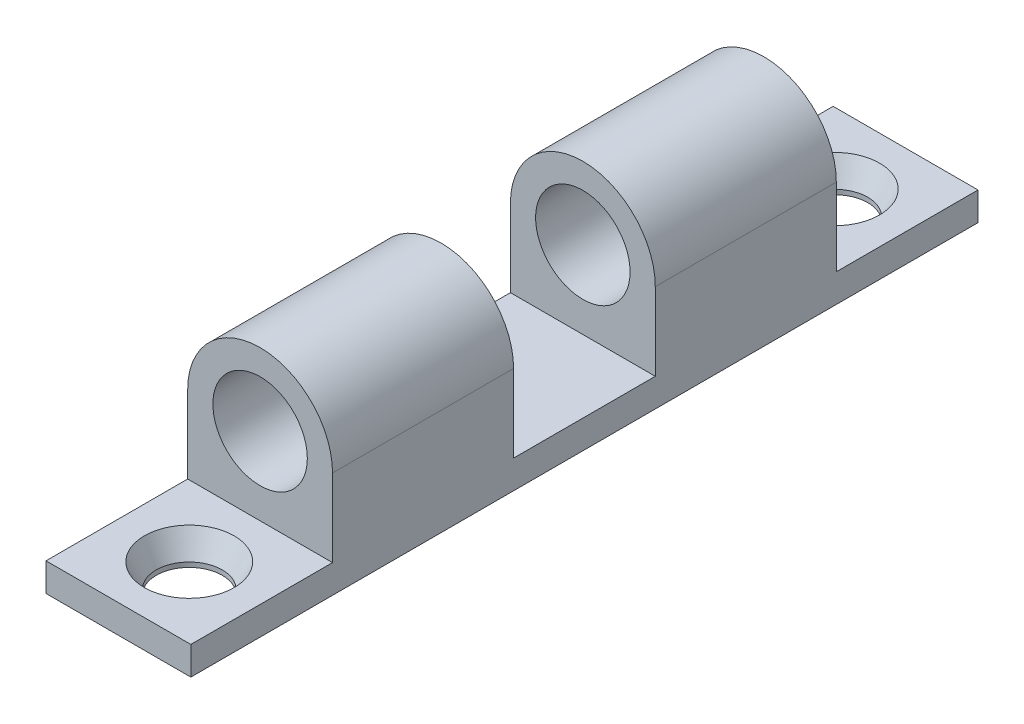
ISO-10303-21;
HEADER;
FILE_DESCRIPTION(('STEP AP214'),'2;1');
FILE_NAME('part.step','',(''),(''),'','','');
FILE_SCHEMA(('AUTOMOTIVE_DESIGN { 1 0 10303 214 1 1 1 1 }'));
ENDSEC;
DATA;
#1=APPLICATION_CONTEXT('core data for automotive mechanical design processes');
#2=APPLICATION_PROTOCOL_DEFINITION('international standard','automotive_design',2000,#1);
#3=PRODUCT_CONTEXT('',#1,'mechanical');
#4=PRODUCT('Part','Part','',(#3));
#5=PRODUCT_RELATED_PRODUCT_CATEGORY('part','',(#4));
#6=PRODUCT_DEFINITION_FORMATION('','',#4);
#7=PRODUCT_DEFINITION_CONTEXT('part definition',#1,'design');
#8=PRODUCT_DEFINITION('design','',#6,#7);
#9=PRODUCT_DEFINITION_SHAPE('','',#8);
#10=(LENGTH_UNIT() NAMED_UNIT(*) SI_UNIT(.MILLI.,.METRE.));
#11=(NAMED_UNIT(*) PLANE_ANGLE_UNIT() SI_UNIT($,.RADIAN.));
#12=(NAMED_UNIT(*) SI_UNIT($,.STERADIAN.) SOLID_ANGLE_UNIT());
#13=UNCERTAINTY_MEASURE_WITH_UNIT(LENGTH_MEASURE(1.E-05),#10,'distance_accuracy_value','');
#14=(GEOMETRIC_REPRESENTATION_CONTEXT(3) GLOBAL_UNCERTAINTY_ASSIGNED_CONTEXT((#13)) GLOBAL_UNIT_ASSIGNED_CONTEXT((#10,
#11,#12)) REPRESENTATION_CONTEXT('',''));
#15=CARTESIAN_POINT('',(0.,0.,0.));
#16=DIRECTION('',(0.,0.,1.));
#17=DIRECTION('',(1.,0.,0.));
#18=AXIS2_PLACEMENT_3D('',#15,#16,#17);
#19=CARTESIAN_POINT('',(0.,6.73,0.));
#20=DIRECTION('',(0.,0.,1.));
#21=DIRECTION('',(1.,0.,0.));
#22=AXIS2_PLACEMENT_3D('',#19,#20,#21);
#23=CYLINDRICAL_SURFACE('',#22,3.);
#24=CARTESIAN_POINT('',(0.,6.73,-4.5));
#25=DIRECTION('',(0.,0.,1.));
#26=DIRECTION('',(1.,0.,0.));
#27=AXIS2_PLACEMENT_3D('',#24,#25,#26);
#28=CIRCLE('',#27,3.);
#29=CARTESIAN_POINT('',(3.,6.73,-4.5));
#30=VERTEX_POINT('',#29);
#31=EDGE_CURVE('E198',#30,#30,#28,.T.);
#32=ORIENTED_EDGE('',*,*,#31,.T.);
#33=EDGE_LOOP('',(#32));
#34=FACE_BOUND('',#33,.T.);
#35=CARTESIAN_POINT('',(0.,6.73,-16.));
#36=DIRECTION('',(0.,0.,1.));
#37=DIRECTION('',(1.,0.,0.));
#38=AXIS2_PLACEMENT_3D('',#35,#36,#37);
#39=CIRCLE('',#38,3.);
#40=CARTESIAN_POINT('',(3.,6.73,-16.));
#41=VERTEX_POINT('',#40);
#42=EDGE_CURVE('E19',#41,#41,#39,.F.);
#43=ORIENTED_EDGE('',*,*,#42,.T.);
#44=EDGE_LOOP('',(#43));
#45=FACE_BOUND('',#44,.T.);
#46=ADVANCED_FACE('F16',(#34,#45),#23,.F.);
#47=CARTESIAN_POINT('',(0.,6.73,0.));
#48=DIRECTION('',(0.,0.,1.));
#49=DIRECTION('',(1.,0.,0.));
#50=AXIS2_PLACEMENT_3D('',#47,#48,#49);
#51=CYLINDRICAL_SURFACE('',#50,3.);
#52=CARTESIAN_POINT('',(0.,6.73,16.));
#53=DIRECTION('',(0.,0.,1.));
#54=DIRECTION('',(1.,0.,0.));
#55=AXIS2_PLACEMENT_3D('',#52,#53,#54);
#56=CIRCLE('',#55,3.);
#57=CARTESIAN_POINT('',(3.,6.73,16.));
#58=VERTEX_POINT('',#57);
#59=EDGE_CURVE('E187',#58,#58,#56,.T.);
#60=ORIENTED_EDGE('',*,*,#59,.T.);
#61=EDGE_LOOP('',(#60));
#62=FACE_BOUND('',#61,.T.);
#63=CARTESIAN_POINT('',(0.,6.73,4.5));
#64=DIRECTION('',(0.,0.,1.));
#65=DIRECTION('',(1.,0.,0.));
#66=AXIS2_PLACEMENT_3D('',#63,#64,#65);
#67=CIRCLE('',#66,3.);
#68=CARTESIAN_POINT('',(3.,6.73,4.5));
#69=VERTEX_POINT('',#68);
#70=EDGE_CURVE('E194',#69,#69,#67,.F.);
#71=ORIENTED_EDGE('',*,*,#70,.T.);
#72=EDGE_LOOP('',(#71));
#73=FACE_BOUND('',#72,.T.);
#74=ADVANCED_FACE('F329',(#62,#73),#51,.F.);
#75=CARTESIAN_POINT('',(4.6,1.8,-16.));
#76=DIRECTION('',(0.,0.,1.));
#77=DIRECTION('',(1.,0.,0.));
#78=AXIS2_PLACEMENT_3D('',#75,#76,#77);
#79=PLANE('',#78);
#80=ORIENTED_EDGE('',*,*,#42,.F.);
#81=EDGE_LOOP('',(#80));
#82=FACE_BOUND('',#81,.T.);
#83=DIRECTION('',(0.,1.,0.));
#84=VECTOR('',#83,1.);
#85=CARTESIAN_POINT('',(4.6,6.73,-16.));
#86=LINE('',#85,#84);
#87=CARTESIAN_POINT('',(4.6,1.8,-16.));
#88=VERTEX_POINT('',#87);
#89=CARTESIAN_POINT('',(4.6,6.73,-16.));
#90=VERTEX_POINT('',#89);
#91=EDGE_CURVE('E106',#88,#90,#86,.T.);
#92=ORIENTED_EDGE('',*,*,#91,.F.);
#93=DIRECTION('',(1.,0.,0.));
#94=VECTOR('',#93,1.);
#95=CARTESIAN_POINT('',(0.,1.8,-16.));
#96=LINE('',#95,#94);
#97=CARTESIAN_POINT('',(-4.6,1.8,-16.));
#98=VERTEX_POINT('',#97);
#99=EDGE_CURVE('E133',#98,#88,#96,.T.);
#100=ORIENTED_EDGE('',*,*,#99,.F.);
#101=DIRECTION('',(0.,1.,0.));
#102=VECTOR('',#101,1.);
#103=CARTESIAN_POINT('',(-4.6,0.,-16.));
#104=LINE('',#103,#102);
#105=CARTESIAN_POINT('',(-4.6,6.73,-16.));
#106=VERTEX_POINT('',#105);
#107=EDGE_CURVE('E109',#106,#98,#104,.F.);
#108=ORIENTED_EDGE('',*,*,#107,.F.);
#109=CARTESIAN_POINT('',(0.,6.73,-16.));
#110=DIRECTION('',(0.,0.,1.));
#111=DIRECTION('',(1.,0.,0.));
#112=AXIS2_PLACEMENT_3D('',#109,#110,#111);
#113=CIRCLE('',#112,4.6);
#114=EDGE_CURVE('E102',#90,#106,#113,.T.);
#115=ORIENTED_EDGE('',*,*,#114,.F.);
#116=EDGE_LOOP('',(#92,#100,#108,#115));
#117=FACE_BOUND('',#116,.T.);
#118=ADVANCED_FACE('F104',(#82,#117),#79,.F.);
#119=CARTESIAN_POINT('',(0.,6.73,0.));
#120=DIRECTION('',(0.,0.,1.));
#121=DIRECTION('',(1.,0.,0.));
#122=AXIS2_PLACEMENT_3D('',#119,#120,#121);
#123=CYLINDRICAL_SURFACE('',#122,4.6);
#124=CARTESIAN_POINT('',(0.,6.73,-4.5));
#125=DIRECTION('',(0.,0.,1.));
#126=DIRECTION('',(1.,0.,0.));
#127=AXIS2_PLACEMENT_3D('',#124,#125,#126);
#128=CIRCLE('',#127,4.6);
#129=CARTESIAN_POINT('',(-4.6,6.73,-4.5));
#130=VERTEX_POINT('',#129);
#131=CARTESIAN_POINT('',(4.6,6.73,-4.5));
#132=VERTEX_POINT('',#131);
#133=EDGE_CURVE('E113',#130,#132,#128,.F.);
#134=ORIENTED_EDGE('',*,*,#133,.T.);
#135=DIRECTION('',(0.,0.,-1.));
#136=VECTOR('',#135,1.);
#137=CARTESIAN_POINT('',(4.6,6.73,0.));
#138=LINE('',#137,#136);
#139=EDGE_CURVE('E115',#90,#132,#138,.F.);
#140=ORIENTED_EDGE('',*,*,#139,.F.);
#141=ORIENTED_EDGE('',*,*,#114,.T.);
#142=DIRECTION('',(0.,0.,1.));
#143=VECTOR('',#142,1.);
#144=CARTESIAN_POINT('',(-4.6,6.73,0.));
#145=LINE('',#144,#143);
#146=EDGE_CURVE('E139',#130,#106,#145,.F.);
#147=ORIENTED_EDGE('',*,*,#146,.F.);
#148=EDGE_LOOP('',(#134,#140,#141,#147));
#149=FACE_BOUND('',#148,.T.);
#150=ADVANCED_FACE('F116',(#149),#123,.T.);
#151=CARTESIAN_POINT('',(-4.6,1.8,-4.5));
#152=DIRECTION('',(0.,0.,-1.));
#153=DIRECTION('',(-1.,0.,0.));
#154=AXIS2_PLACEMENT_3D('',#151,#152,#153);
#155=PLANE('',#154);
#156=ORIENTED_EDGE('',*,*,#31,.F.);
#157=EDGE_LOOP('',(#156));
#158=FACE_BOUND('',#157,.T.);
#159=DIRECTION('',(0.,1.,0.));
#160=VECTOR('',#159,1.);
#161=CARTESIAN_POINT('',(-4.6,0.,-4.5));
#162=LINE('',#161,#160);
#163=CARTESIAN_POINT('',(-4.6,1.8,-4.5));
#164=VERTEX_POINT('',#163);
#165=EDGE_CURVE('E141',#164,#130,#162,.T.);
#166=ORIENTED_EDGE('',*,*,#165,.F.);
#167=DIRECTION('',(1.,0.,0.));
#168=VECTOR('',#167,1.);
#169=CARTESIAN_POINT('',(0.,1.8,-4.5));
#170=LINE('',#169,#168);
#171=CARTESIAN_POINT('',(4.6,1.8,-4.5));
#172=VERTEX_POINT('',#171);
#173=EDGE_CURVE('E201',#172,#164,#170,.F.);
#174=ORIENTED_EDGE('',*,*,#173,.F.);
#175=DIRECTION('',(0.,1.,0.));
#176=VECTOR('',#175,1.);
#177=CARTESIAN_POINT('',(4.6,6.73,-4.5));
#178=LINE('',#177,#176);
#179=EDGE_CURVE('E120',#132,#172,#178,.F.);
#180=ORIENTED_EDGE('',*,*,#179,.F.);
#181=ORIENTED_EDGE('',*,*,#133,.F.);
#182=EDGE_LOOP('',(#166,#174,#180,#181));
#183=FACE_BOUND('',#182,.T.);
#184=ADVANCED_FACE('F322',(#158,#183),#155,.F.);
#185=CARTESIAN_POINT('',(0.,1.8,0.));
#186=DIRECTION('',(0.,1.,0.));
#187=DIRECTION('',(0.,0.,1.));
#188=AXIS2_PLACEMENT_3D('',#185,#186,#187);
#189=PLANE('',#188);
#190=DIRECTION('',(0.,0.,-1.));
#191=VECTOR('',#190,1.);
#192=CARTESIAN_POINT('',(4.6,1.8,0.));
#193=LINE('',#192,#191);
#194=CARTESIAN_POINT('',(4.6,1.8,4.5));
#195=VERTEX_POINT('',#194);
#196=EDGE_CURVE('E211',#172,#195,#193,.F.);
#197=ORIENTED_EDGE('',*,*,#196,.F.);
#198=ORIENTED_EDGE('',*,*,#173,.T.);
#199=DIRECTION('',(0.,0.,1.));
#200=VECTOR('',#199,1.);
#201=CARTESIAN_POINT('',(-4.6,1.8,0.));
#202=LINE('',#201,#200);
#203=CARTESIAN_POINT('',(-4.6,1.8,4.5));
#204=VERTEX_POINT('',#203);
#205=EDGE_CURVE('E144',#204,#164,#202,.F.);
#206=ORIENTED_EDGE('',*,*,#205,.F.);
#207=DIRECTION('',(1.,0.,0.));
#208=VECTOR('',#207,1.);
#209=CARTESIAN_POINT('',(4.6,1.8,4.5));
#210=LINE('',#209,#208);
#211=EDGE_CURVE('E197',#204,#195,#210,.T.);
#212=ORIENTED_EDGE('',*,*,#211,.T.);
#213=EDGE_LOOP('',(#197,#198,#206,#212));
#214=FACE_BOUND('',#213,.T.);
#215=ADVANCED_FACE('F318',(#214),#189,.T.);
#216=CARTESIAN_POINT('',(4.6,1.8,4.5));
#217=DIRECTION('',(0.,0.,1.));
#218=DIRECTION('',(1.,0.,0.));
#219=AXIS2_PLACEMENT_3D('',#216,#217,#218);
#220=PLANE('',#219);
#221=ORIENTED_EDGE('',*,*,#70,.F.);
#222=EDGE_LOOP('',(#221));
#223=FACE_BOUND('',#222,.T.);
#224=DIRECTION('',(0.,1.,0.));
#225=VECTOR('',#224,1.);
#226=CARTESIAN_POINT('',(4.6,6.73,4.5));
#227=LINE('',#226,#225);
#228=CARTESIAN_POINT('',(4.6,6.73,4.5));
#229=VERTEX_POINT('',#228);
#230=EDGE_CURVE('E213',#195,#229,#227,.T.);
#231=ORIENTED_EDGE('',*,*,#230,.F.);
#232=ORIENTED_EDGE('',*,*,#211,.F.);
#233=DIRECTION('',(0.,1.,0.));
#234=VECTOR('',#233,1.);
#235=CARTESIAN_POINT('',(-4.6,0.,4.5));
#236=LINE('',#235,#234);
#237=CARTESIAN_POINT('',(-4.6,6.73,4.5));
#238=VERTEX_POINT('',#237);
#239=EDGE_CURVE('E147',#238,#204,#236,.F.);
#240=ORIENTED_EDGE('',*,*,#239,.F.);
#241=CARTESIAN_POINT('',(0.,6.73,4.5));
#242=DIRECTION('',(0.,0.,1.));
#243=DIRECTION('',(1.,0.,0.));
#244=AXIS2_PLACEMENT_3D('',#241,#242,#243);
#245=CIRCLE('',#244,4.6);
#246=EDGE_CURVE('E192',#229,#238,#245,.T.);
#247=ORIENTED_EDGE('',*,*,#246,.F.);
#248=EDGE_LOOP('',(#231,#232,#240,#247));
#249=FACE_BOUND('',#248,.T.);
#250=ADVANCED_FACE('F314',(#223,#249),#220,.F.);
#251=CARTESIAN_POINT('',(0.,6.73,0.));
#252=DIRECTION('',(0.,0.,1.));
#253=DIRECTION('',(1.,0.,0.));
#254=AXIS2_PLACEMENT_3D('',#251,#252,#253);
#255=CYLINDRICAL_SURFACE('',#254,4.6);
#256=ORIENTED_EDGE('',*,*,#246,.T.);
#257=DIRECTION('',(0.,0.,1.));
#258=VECTOR('',#257,1.);
#259=CARTESIAN_POINT('',(-4.6,6.73,0.));
#260=LINE('',#259,#258);
#261=CARTESIAN_POINT('',(-4.6,6.73,16.));
#262=VERTEX_POINT('',#261);
#263=EDGE_CURVE('E150',#262,#238,#260,.F.);
#264=ORIENTED_EDGE('',*,*,#263,.F.);
#265=CARTESIAN_POINT('',(0.,6.73,16.));
#266=DIRECTION('',(0.,0.,1.));
#267=DIRECTION('',(1.,0.,0.));
#268=AXIS2_PLACEMENT_3D('',#265,#266,#267);
#269=CIRCLE('',#268,4.6);
#270=CARTESIAN_POINT('',(4.6,6.73,16.));
#271=VERTEX_POINT('',#270);
#272=EDGE_CURVE('E190',#262,#271,#269,.F.);
#273=ORIENTED_EDGE('',*,*,#272,.T.);
#274=DIRECTION('',(0.,0.,-1.));
#275=VECTOR('',#274,1.);
#276=CARTESIAN_POINT('',(4.6,6.73,0.));
#277=LINE('',#276,#275);
#278=EDGE_CURVE('E215',#229,#271,#277,.F.);
#279=ORIENTED_EDGE('',*,*,#278,.F.);
#280=EDGE_LOOP('',(#256,#264,#273,#279));
#281=FACE_BOUND('',#280,.T.);
#282=ADVANCED_FACE('F310',(#281),#255,.T.);
#283=CARTESIAN_POINT('',(-4.6,1.8,16.));
#284=DIRECTION('',(0.,0.,-1.));
#285=DIRECTION('',(-1.,0.,0.));
#286=AXIS2_PLACEMENT_3D('',#283,#284,#285);
#287=PLANE('',#286);
#288=ORIENTED_EDGE('',*,*,#59,.F.);
#289=EDGE_LOOP('',(#288));
#290=FACE_BOUND('',#289,.T.);
#291=DIRECTION('',(0.,1.,0.));
#292=VECTOR('',#291,1.);
#293=CARTESIAN_POINT('',(-4.6,0.,16.));
#294=LINE('',#293,#292);
#295=CARTESIAN_POINT('',(-4.6,1.8,16.));
#296=VERTEX_POINT('',#295);
#297=EDGE_CURVE('E153',#296,#262,#294,.T.);
#298=ORIENTED_EDGE('',*,*,#297,.F.);
#299=DIRECTION('',(1.,0.,0.));
#300=VECTOR('',#299,1.);
#301=CARTESIAN_POINT('',(0.,1.8,16.));
#302=LINE('',#301,#300);
#303=CARTESIAN_POINT('',(4.6,1.8,16.));
#304=VERTEX_POINT('',#303);
#305=EDGE_CURVE('E136',#304,#296,#302,.F.);
#306=ORIENTED_EDGE('',*,*,#305,.F.);
#307=DIRECTION('',(0.,1.,0.));
#308=VECTOR('',#307,1.);
#309=CARTESIAN_POINT('',(4.6,6.73,16.));
#310=LINE('',#309,#308);
#311=EDGE_CURVE('E219',#271,#304,#310,.F.);
#312=ORIENTED_EDGE('',*,*,#311,.F.);
#313=ORIENTED_EDGE('',*,*,#272,.F.);
#314=EDGE_LOOP('',(#298,#306,#312,#313));
#315=FACE_BOUND('',#314,.T.);
#316=ADVANCED_FACE('F306',(#290,#315),#287,.F.);
#317=CARTESIAN_POINT('',(0.,1.8,20.5));
#318=DIRECTION('',(0.,1.,0.));
#319=DIRECTION('',(0.,0.,1.));
#320=AXIS2_PLACEMENT_3D('',#317,#318,#319);
#321=PLANE('',#320);
#322=CARTESIAN_POINT('',(0.,1.80000000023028,20.5));
#323=DIRECTION('',(0.,1.,0.));
#324=DIRECTION('',(-1.,0.,0.));
#325=AXIS2_PLACEMENT_3D('',#322,#323,#324);
#326=CIRCLE('',#325,2.84999999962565);
#327=CARTESIAN_POINT('',(-2.84999999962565,1.80000000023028,20.5));
#328=VERTEX_POINT('',#327);
#329=EDGE_CURVE('E165',#328,#328,#326,.F.);
#330=ORIENTED_EDGE('',*,*,#329,.T.);
#331=EDGE_LOOP('',(#330));
#332=FACE_BOUND('',#331,.T.);
#333=ORIENTED_EDGE('',*,*,#305,.T.);
#334=DIRECTION('',(0.,0.,1.));
#335=VECTOR('',#334,1.);
#336=CARTESIAN_POINT('',(-4.6,1.8,0.));
#337=LINE('',#336,#335);
#338=CARTESIAN_POINT('',(-4.6,1.8,25.));
#339=VERTEX_POINT('',#338);
#340=EDGE_CURVE('E156',#339,#296,#337,.F.);
#341=ORIENTED_EDGE('',*,*,#340,.F.);
#342=DIRECTION('',(1.,0.,0.));
#343=VECTOR('',#342,1.);
#344=CARTESIAN_POINT('',(0.,1.8,25.));
#345=LINE('',#344,#343);
#346=CARTESIAN_POINT('',(4.6,1.8,25.));
#347=VERTEX_POINT('',#346);
#348=EDGE_CURVE('E163',#347,#339,#345,.F.);
#349=ORIENTED_EDGE('',*,*,#348,.F.);
#350=DIRECTION('',(0.,0.,-1.));
#351=VECTOR('',#350,1.);
#352=CARTESIAN_POINT('',(4.6,1.8,0.));
#353=LINE('',#352,#351);
#354=EDGE_CURVE('E178',#304,#347,#353,.F.);
#355=ORIENTED_EDGE('',*,*,#354,.F.);
#356=EDGE_LOOP('',(#333,#341,#349,#355));
#357=FACE_BOUND('',#356,.T.);
#358=ADVANCED_FACE('F298',(#332,#357),#321,.T.);
#359=CARTESIAN_POINT('',(0.,1.8,-20.5));
#360=DIRECTION('',(0.,1.,0.));
#361=DIRECTION('',(0.,0.,1.));
#362=AXIS2_PLACEMENT_3D('',#359,#360,#361);
#363=PLANE('',#362);
#364=CARTESIAN_POINT('',(0.,1.80000000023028,-20.5));
#365=DIRECTION('',(0.,1.,0.));
#366=DIRECTION('',(-1.,0.,0.));
#367=AXIS2_PLACEMENT_3D('',#364,#365,#366);
#368=CIRCLE('',#367,2.84999999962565);
#369=CARTESIAN_POINT('',(-2.84999999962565,1.80000000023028,-20.5));
#370=VERTEX_POINT('',#369);
#371=EDGE_CURVE('E135',#370,#370,#368,.F.);
#372=ORIENTED_EDGE('',*,*,#371,.T.);
#373=EDGE_LOOP('',(#372));
#374=FACE_BOUND('',#373,.T.);
#375=ORIENTED_EDGE('',*,*,#99,.T.);
#376=DIRECTION('',(0.,0.,-1.));
#377=VECTOR('',#376,1.);
#378=CARTESIAN_POINT('',(4.6,1.8,0.));
#379=LINE('',#378,#377);
#380=CARTESIAN_POINT('',(4.6,1.8,-25.));
#381=VERTEX_POINT('',#380);
#382=EDGE_CURVE('E125',#381,#88,#379,.F.);
#383=ORIENTED_EDGE('',*,*,#382,.F.);
#384=DIRECTION('',(1.,0.,0.));
#385=VECTOR('',#384,1.);
#386=CARTESIAN_POINT('',(0.,1.8,-25.));
#387=LINE('',#386,#385);
#388=CARTESIAN_POINT('',(-4.6,1.8,-25.));
#389=VERTEX_POINT('',#388);
#390=EDGE_CURVE('E126',#381,#389,#387,.F.);
#391=ORIENTED_EDGE('',*,*,#390,.T.);
#392=DIRECTION('',(0.,0.,1.));
#393=VECTOR('',#392,1.);
#394=CARTESIAN_POINT('',(-4.6,1.8,0.));
#395=LINE('',#394,#393);
#396=EDGE_CURVE('E162',#98,#389,#395,.F.);
#397=ORIENTED_EDGE('',*,*,#396,.F.);
#398=EDGE_LOOP('',(#375,#383,#391,#397));
#399=FACE_BOUND('',#398,.T.);
#400=ADVANCED_FACE('F288',(#374,#399),#363,.T.);
#401=CARTESIAN_POINT('',(0.,1.8000000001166,-20.5));
#402=DIRECTION('',(0.,1.,0.));
#403=DIRECTION('',(-1.,0.,0.));
#404=AXIS2_PLACEMENT_3D('',#401,#402,#403);
#405=CONICAL_SURFACE('',#404,2.84999999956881,0.463647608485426);
#406=ORIENTED_EDGE('',*,*,#371,.F.);
#407=EDGE_LOOP('',(#406));
#408=FACE_BOUND('',#407,.T.);
#409=CARTESIAN_POINT('',(0.,0.300000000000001,-20.5));
#410=DIRECTION('',(0.,-1.,0.));
#411=DIRECTION('',(1.,0.,0.));
#412=AXIS2_PLACEMENT_3D('',#409,#410,#411);
#413=CIRCLE('',#412,2.1);
#414=CARTESIAN_POINT('',(2.1,0.300000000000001,-20.5));
#415=VERTEX_POINT('',#414);
#416=EDGE_CURVE('E138',#415,#415,#413,.T.);
#417=ORIENTED_EDGE('',*,*,#416,.T.);
#418=EDGE_LOOP('',(#417));
#419=FACE_BOUND('',#418,.T.);
#420=ADVANCED_FACE('F285',(#408,#419),#405,.F.);
#421=CARTESIAN_POINT('',(0.,1.8000000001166,20.5));
#422=DIRECTION('',(0.,1.,0.));
#423=DIRECTION('',(-1.,0.,0.));
#424=AXIS2_PLACEMENT_3D('',#421,#422,#423);
#425=CONICAL_SURFACE('',#424,2.84999999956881,0.463647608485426);
#426=ORIENTED_EDGE('',*,*,#329,.F.);
#427=EDGE_LOOP('',(#426));
#428=FACE_BOUND('',#427,.T.);
#429=CARTESIAN_POINT('',(0.,0.300000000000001,20.5));
#430=DIRECTION('',(0.,-1.,0.));
#431=DIRECTION('',(1.,0.,0.));
#432=AXIS2_PLACEMENT_3D('',#429,#430,#431);
#433=CIRCLE('',#432,2.1);
#434=CARTESIAN_POINT('',(2.1,0.300000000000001,20.5));
#435=VERTEX_POINT('',#434);
#436=EDGE_CURVE('E173',#435,#435,#433,.T.);
#437=ORIENTED_EDGE('',*,*,#436,.T.);
#438=EDGE_LOOP('',(#437));
#439=FACE_BOUND('',#438,.T.);
#440=ADVANCED_FACE('F287',(#428,#439),#425,.F.);
#441=CARTESIAN_POINT('',(0.,4.86929797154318,25.));
#442=DIRECTION('',(0.,0.,1.));
#443=DIRECTION('',(1.,0.,0.));
#444=AXIS2_PLACEMENT_3D('',#441,#442,#443);
#445=PLANE('',#444);
#446=DIRECTION('',(1.,0.,0.));
#447=VECTOR('',#446,1.);
#448=CARTESIAN_POINT('',(4.6,0.,25.));
#449=LINE('',#448,#447);
#450=CARTESIAN_POINT('',(4.6,0.,25.));
#451=VERTEX_POINT('',#450);
#452=CARTESIAN_POINT('',(-4.6,0.,25.));
#453=VERTEX_POINT('',#452);
#454=EDGE_CURVE('E170',#451,#453,#449,.F.);
#455=ORIENTED_EDGE('',*,*,#454,.F.);
#456=DIRECTION('',(0.,1.,0.));
#457=VECTOR('',#456,1.);
#458=CARTESIAN_POINT('',(4.6,6.73,25.));
#459=LINE('',#458,#457);
#460=EDGE_CURVE('E176',#347,#451,#459,.F.);
#461=ORIENTED_EDGE('',*,*,#460,.F.);
#462=ORIENTED_EDGE('',*,*,#348,.T.);
#463=DIRECTION('',(0.,1.,0.));
#464=VECTOR('',#463,1.);
#465=CARTESIAN_POINT('',(-4.6,0.,25.));
#466=LINE('',#465,#464);
#467=EDGE_CURVE('E159',#453,#339,#466,.T.);
#468=ORIENTED_EDGE('',*,*,#467,.F.);
#469=EDGE_LOOP('',(#455,#461,#462,#468));
#470=FACE_BOUND('',#469,.T.);
#471=ADVANCED_FACE('F245',(#470),#445,.T.);
#472=CARTESIAN_POINT('',(-4.6,0.,0.));
#473=DIRECTION('',(-1.,0.,0.));
#474=DIRECTION('',(0.,0.,1.));
#475=AXIS2_PLACEMENT_3D('',#472,#473,#474);
#476=PLANE('',#475);
#477=ORIENTED_EDGE('',*,*,#165,.T.);
#478=ORIENTED_EDGE('',*,*,#146,.T.);
#479=ORIENTED_EDGE('',*,*,#107,.T.);
#480=ORIENTED_EDGE('',*,*,#396,.T.);
#481=DIRECTION('',(0.,1.,0.));
#482=VECTOR('',#481,1.);
#483=CARTESIAN_POINT('',(-4.6,4.86929797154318,-25.));
#484=LINE('',#483,#482);
#485=CARTESIAN_POINT('',(-4.6,0.,-25.));
#486=VERTEX_POINT('',#485);
#487=EDGE_CURVE('E129',#389,#486,#484,.F.);
#488=ORIENTED_EDGE('',*,*,#487,.T.);
#489=DIRECTION('',(0.,0.,-1.));
#490=VECTOR('',#489,1.);
#491=CARTESIAN_POINT('',(-4.6,0.,0.));
#492=LINE('',#491,#490);
#493=EDGE_CURVE('E166',#453,#486,#492,.T.);
#494=ORIENTED_EDGE('',*,*,#493,.F.);
#495=ORIENTED_EDGE('',*,*,#467,.T.);
#496=ORIENTED_EDGE('',*,*,#340,.T.);
#497=ORIENTED_EDGE('',*,*,#297,.T.);
#498=ORIENTED_EDGE('',*,*,#263,.T.);
#499=ORIENTED_EDGE('',*,*,#239,.T.);
#500=ORIENTED_EDGE('',*,*,#205,.T.);
#501=EDGE_LOOP('',(#477,#478,#479,#480,#488,#494,#495,#496,#497,#498,#499,#500));
#502=FACE_BOUND('',#501,.T.);
#503=ADVANCED_FACE('F249',(#502),#476,.T.);
#504=CARTESIAN_POINT('',(0.,4.86929797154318,-25.));
#505=DIRECTION('',(0.,0.,1.));
#506=DIRECTION('',(1.,0.,0.));
#507=AXIS2_PLACEMENT_3D('',#504,#505,#506);
#508=PLANE('',#507);
#509=DIRECTION('',(0.,1.,0.));
#510=VECTOR('',#509,1.);
#511=CARTESIAN_POINT('',(4.6,6.73,-25.));
#512=LINE('',#511,#510);
#513=CARTESIAN_POINT('',(4.6,0.,-25.));
#514=VERTEX_POINT('',#513);
#515=EDGE_CURVE('E34',#514,#381,#512,.T.);
#516=ORIENTED_EDGE('',*,*,#515,.F.);
#517=DIRECTION('',(1.,0.,0.));
#518=VECTOR('',#517,1.);
#519=CARTESIAN_POINT('',(4.6,0.,-25.));
#520=LINE('',#519,#518);
#521=EDGE_CURVE('E169',#486,#514,#520,.T.);
#522=ORIENTED_EDGE('',*,*,#521,.F.);
#523=ORIENTED_EDGE('',*,*,#487,.F.);
#524=ORIENTED_EDGE('',*,*,#390,.F.);
#525=EDGE_LOOP('',(#516,#522,#523,#524));
#526=FACE_BOUND('',#525,.T.);
#527=ADVANCED_FACE('F252',(#526),#508,.F.);
#528=CARTESIAN_POINT('',(4.6,6.73,0.));
#529=DIRECTION('',(1.,0.,0.));
#530=DIRECTION('',(0.,0.,-1.));
#531=AXIS2_PLACEMENT_3D('',#528,#529,#530);
#532=PLANE('',#531);
#533=ORIENTED_EDGE('',*,*,#515,.T.);
#534=ORIENTED_EDGE('',*,*,#382,.T.);
#535=ORIENTED_EDGE('',*,*,#91,.T.);
#536=ORIENTED_EDGE('',*,*,#139,.T.);
#537=ORIENTED_EDGE('',*,*,#179,.T.);
#538=ORIENTED_EDGE('',*,*,#196,.T.);
#539=ORIENTED_EDGE('',*,*,#230,.T.);
#540=ORIENTED_EDGE('',*,*,#278,.T.);
#541=ORIENTED_EDGE('',*,*,#311,.T.);
#542=ORIENTED_EDGE('',*,*,#354,.T.);
#543=ORIENTED_EDGE('',*,*,#460,.T.);
#544=DIRECTION('',(0.,0.,-1.));
#545=VECTOR('',#544,1.);
#546=CARTESIAN_POINT('',(4.6,0.,0.));
#547=LINE('',#546,#545);
#548=EDGE_CURVE('E182',#514,#451,#547,.F.);
#549=ORIENTED_EDGE('',*,*,#548,.F.);
#550=EDGE_LOOP('',(#533,#534,#535,#536,#537,#538,#539,#540,#541,#542,#543,#549));
#551=FACE_BOUND('',#550,.T.);
#552=ADVANCED_FACE('F123',(#551),#532,.T.);
#553=CARTESIAN_POINT('',(0.,1.8,-20.5));
#554=DIRECTION('',(0.,-1.,0.));
#555=DIRECTION('',(1.,0.,0.));
#556=AXIS2_PLACEMENT_3D('',#553,#554,#555);
#557=CYLINDRICAL_SURFACE('',#556,2.1);
#558=ORIENTED_EDGE('',*,*,#416,.F.);
#559=EDGE_LOOP('',(#558));
#560=FACE_BOUND('',#559,.T.);
#561=CARTESIAN_POINT('',(0.,0.,-20.5));
#562=DIRECTION('',(0.,-1.,0.));
#563=DIRECTION('',(1.,0.,0.));
#564=AXIS2_PLACEMENT_3D('',#561,#562,#563);
#565=CIRCLE('',#564,2.1);
#566=CARTESIAN_POINT('',(2.1,0.,-20.5));
#567=VERTEX_POINT('',#566);
#568=EDGE_CURVE('E25',#567,#567,#565,.F.);
#569=ORIENTED_EDGE('',*,*,#568,.F.);
#570=EDGE_LOOP('',(#569));
#571=FACE_BOUND('',#570,.T.);
#572=ADVANCED_FACE('F261',(#560,#571),#557,.F.);
#573=CARTESIAN_POINT('',(0.,1.8,20.5));
#574=DIRECTION('',(0.,-1.,0.));
#575=DIRECTION('',(1.,0.,0.));
#576=AXIS2_PLACEMENT_3D('',#573,#574,#575);
#577=CYLINDRICAL_SURFACE('',#576,2.1);
#578=ORIENTED_EDGE('',*,*,#436,.F.);
#579=EDGE_LOOP('',(#578));
#580=FACE_BOUND('',#579,.T.);
#581=CARTESIAN_POINT('',(0.,0.,20.5));
#582=DIRECTION('',(0.,-1.,0.));
#583=DIRECTION('',(1.,0.,0.));
#584=AXIS2_PLACEMENT_3D('',#581,#582,#583);
#585=CIRCLE('',#584,2.1);
#586=CARTESIAN_POINT('',(2.1,0.,20.5));
#587=VERTEX_POINT('',#586);
#588=EDGE_CURVE('E11',#587,#587,#585,.F.);
#589=ORIENTED_EDGE('',*,*,#588,.F.);
#590=EDGE_LOOP('',(#589));
#591=FACE_BOUND('',#590,.T.);
#592=ADVANCED_FACE('F265',(#580,#591),#577,.F.);
#593=CARTESIAN_POINT('',(4.6,0.,0.));
#594=DIRECTION('',(0.,-1.,0.));
#595=DIRECTION('',(0.,0.,-1.));
#596=AXIS2_PLACEMENT_3D('',#593,#594,#595);
#597=PLANE('',#596);
#598=ORIENTED_EDGE('',*,*,#588,.T.);
#599=EDGE_LOOP('',(#598));
#600=FACE_BOUND('',#599,.T.);
#601=ORIENTED_EDGE('',*,*,#568,.T.);
#602=EDGE_LOOP('',(#601));
#603=FACE_BOUND('',#602,.T.);
#604=ORIENTED_EDGE('',*,*,#521,.T.);
#605=ORIENTED_EDGE('',*,*,#548,.T.);
#606=ORIENTED_EDGE('',*,*,#454,.T.);
#607=ORIENTED_EDGE('',*,*,#493,.T.);
#608=EDGE_LOOP('',(#604,#605,#606,#607));
#609=FACE_BOUND('',#608,.T.);
#610=ADVANCED_FACE('F241',(#600,#603,#609),#597,.T.);
#611=CLOSED_SHELL('',(#46,#74,#118,#150,#184,#215,#250,#282,#316,#358,#400,#420,#440,#471,#503,
#527,#552,#572,#592,#610));
#612=MANIFOLD_SOLID_BREP('B1',#611);
#613=ADVANCED_BREP_SHAPE_REPRESENTATION('',(#18,#612),#14);
#614=SHAPE_DEFINITION_REPRESENTATION(#9,#613);
ENDSEC;
END-ISO-10303-21;
